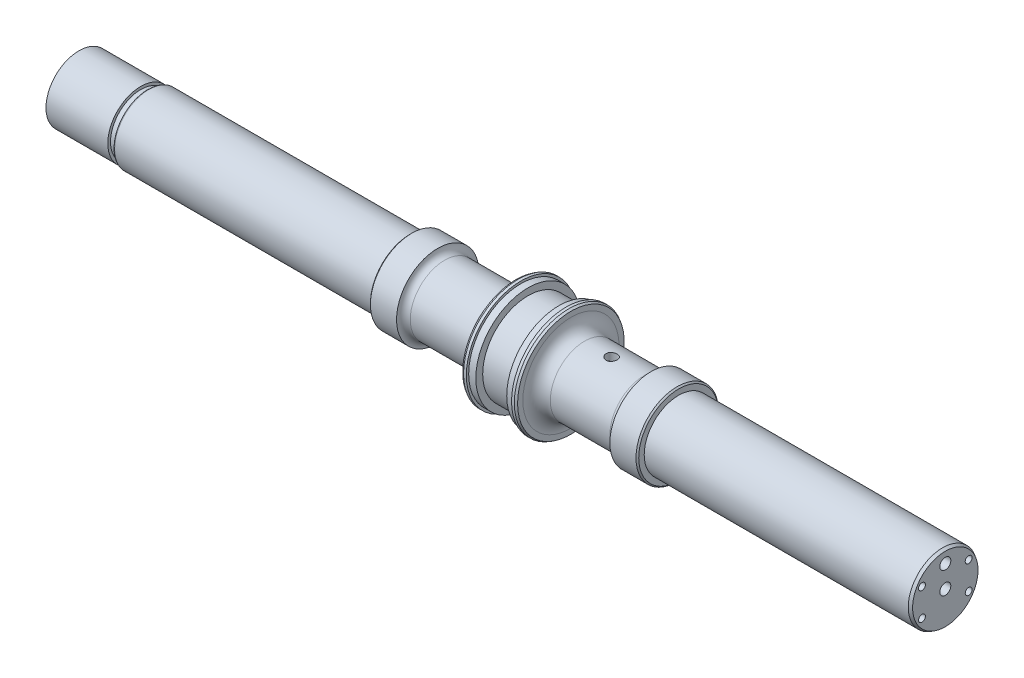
ISO-10303-21;
HEADER;
FILE_DESCRIPTION(('STEP AP214'),'2;1');
FILE_NAME('part.step','',(''),(''),'','','');
FILE_SCHEMA(('AUTOMOTIVE_DESIGN { 1 0 10303 214 1 1 1 1 }'));
ENDSEC;
DATA;
#1=APPLICATION_CONTEXT('core data for automotive mechanical design processes');
#2=APPLICATION_PROTOCOL_DEFINITION('international standard','automotive_design',2000,#1);
#3=PRODUCT_CONTEXT('',#1,'mechanical');
#4=PRODUCT('Part','Part','',(#3));
#5=PRODUCT_RELATED_PRODUCT_CATEGORY('part','',(#4));
#6=PRODUCT_DEFINITION_FORMATION('','',#4);
#7=PRODUCT_DEFINITION_CONTEXT('part definition',#1,'design');
#8=PRODUCT_DEFINITION('design','',#6,#7);
#9=PRODUCT_DEFINITION_SHAPE('','',#8);
#10=(LENGTH_UNIT() NAMED_UNIT(*) SI_UNIT(.MILLI.,.METRE.));
#11=(NAMED_UNIT(*) PLANE_ANGLE_UNIT() SI_UNIT($,.RADIAN.));
#12=(NAMED_UNIT(*) SI_UNIT($,.STERADIAN.) SOLID_ANGLE_UNIT());
#13=UNCERTAINTY_MEASURE_WITH_UNIT(LENGTH_MEASURE(1.E-05),#10,'distance_accuracy_value','');
#14=(GEOMETRIC_REPRESENTATION_CONTEXT(3) GLOBAL_UNCERTAINTY_ASSIGNED_CONTEXT((#13)) GLOBAL_UNIT_ASSIGNED_CONTEXT((#10,
#11,#12)) REPRESENTATION_CONTEXT('',''));
#15=CARTESIAN_POINT('',(0.,0.,0.));
#16=DIRECTION('',(0.,0.,1.));
#17=DIRECTION('',(1.,0.,0.));
#18=AXIS2_PLACEMENT_3D('',#15,#16,#17);
#19=CARTESIAN_POINT('',(0.,0.,0.));
#20=DIRECTION('',(1.,0.,0.));
#21=DIRECTION('',(0.,0.,-1.));
#22=AXIS2_PLACEMENT_3D('',#19,#20,#21);
#23=PLANE('',#22);
#24=CARTESIAN_POINT('',(0.,0.,0.));
#25=DIRECTION('',(-1.,0.,0.));
#26=DIRECTION('',(0.,0.,1.));
#27=AXIS2_PLACEMENT_3D('',#24,#25,#26);
#28=CIRCLE('',#27,24.);
#29=CARTESIAN_POINT('',(0.,0.,24.));
#30=VERTEX_POINT('',#29);
#31=EDGE_CURVE('E144',#30,#30,#28,.T.);
#32=ORIENTED_EDGE('',*,*,#31,.T.);
#33=EDGE_LOOP('',(#32));
#34=FACE_BOUND('',#33,.T.);
#35=ADVANCED_FACE('F32',(#34),#23,.F.);
#36=CARTESIAN_POINT('',(0.,0.,0.));
#37=DIRECTION('',(-1.,0.,0.));
#38=DIRECTION('',(0.,0.,1.));
#39=AXIS2_PLACEMENT_3D('',#36,#37,#38);
#40=CYLINDRICAL_SURFACE('',#39,24.);
#41=ORIENTED_EDGE('',*,*,#31,.F.);
#42=EDGE_LOOP('',(#41));
#43=FACE_BOUND('',#42,.T.);
#44=CARTESIAN_POINT('',(45.,0.,0.));
#45=DIRECTION('',(-1.,0.,0.));
#46=DIRECTION('',(0.,0.,1.));
#47=AXIS2_PLACEMENT_3D('',#44,#45,#46);
#48=CIRCLE('',#47,24.);
#49=CARTESIAN_POINT('',(45.,0.,24.));
#50=VERTEX_POINT('',#49);
#51=EDGE_CURVE('E141',#50,#50,#48,.T.);
#52=ORIENTED_EDGE('',*,*,#51,.T.);
#53=EDGE_LOOP('',(#52));
#54=FACE_BOUND('',#53,.T.);
#55=ADVANCED_FACE('F297',(#43,#54),#40,.T.);
#56=CARTESIAN_POINT('',(45.,24.,0.));
#57=DIRECTION('',(-1.,0.,0.));
#58=DIRECTION('',(0.,0.,1.));
#59=AXIS2_PLACEMENT_3D('',#56,#57,#58);
#60=PLANE('',#59);
#61=ORIENTED_EDGE('',*,*,#51,.F.);
#62=EDGE_LOOP('',(#61));
#63=FACE_BOUND('',#62,.T.);
#64=CARTESIAN_POINT('',(45.,0.,0.));
#65=DIRECTION('',(-1.,0.,0.));
#66=DIRECTION('',(0.,0.,1.));
#67=AXIS2_PLACEMENT_3D('',#64,#65,#66);
#68=CIRCLE('',#67,22.);
#69=CARTESIAN_POINT('',(45.,0.,22.));
#70=VERTEX_POINT('',#69);
#71=EDGE_CURVE('E138',#70,#70,#68,.T.);
#72=ORIENTED_EDGE('',*,*,#71,.T.);
#73=EDGE_LOOP('',(#72));
#74=FACE_BOUND('',#73,.T.);
#75=ADVANCED_FACE('F303',(#63,#74),#60,.F.);
#76=CARTESIAN_POINT('',(0.,0.,0.));
#77=DIRECTION('',(-1.,0.,0.));
#78=DIRECTION('',(0.,0.,1.));
#79=AXIS2_PLACEMENT_3D('',#76,#77,#78);
#80=CYLINDRICAL_SURFACE('',#79,22.);
#81=ORIENTED_EDGE('',*,*,#71,.F.);
#82=EDGE_LOOP('',(#81));
#83=FACE_BOUND('',#82,.T.);
#84=CARTESIAN_POINT('',(50.,0.,0.));
#85=DIRECTION('',(-1.,0.,0.));
#86=DIRECTION('',(0.,0.,1.));
#87=AXIS2_PLACEMENT_3D('',#84,#85,#86);
#88=CIRCLE('',#87,22.);
#89=CARTESIAN_POINT('',(50.,0.,22.));
#90=VERTEX_POINT('',#89);
#91=EDGE_CURVE('E135',#90,#90,#88,.T.);
#92=ORIENTED_EDGE('',*,*,#91,.T.);
#93=EDGE_LOOP('',(#92));
#94=FACE_BOUND('',#93,.T.);
#95=ADVANCED_FACE('F414',(#83,#94),#80,.T.);
#96=CARTESIAN_POINT('',(50.,22.,0.));
#97=DIRECTION('',(1.,0.,0.));
#98=DIRECTION('',(0.,0.,-1.));
#99=AXIS2_PLACEMENT_3D('',#96,#97,#98);
#100=PLANE('',#99);
#101=CARTESIAN_POINT('',(50.,0.,0.));
#102=DIRECTION('',(1.,0.,0.));
#103=DIRECTION('',(0.,0.,-1.));
#104=AXIS2_PLACEMENT_3D('',#101,#102,#103);
#105=CIRCLE('',#104,24.);
#106=CARTESIAN_POINT('',(50.,0.,-24.));
#107=VERTEX_POINT('',#106);
#108=EDGE_CURVE('E177',#107,#107,#105,.F.);
#109=ORIENTED_EDGE('',*,*,#108,.T.);
#110=EDGE_LOOP('',(#109));
#111=FACE_BOUND('',#110,.T.);
#112=ORIENTED_EDGE('',*,*,#91,.F.);
#113=EDGE_LOOP('',(#112));
#114=FACE_BOUND('',#113,.T.);
#115=ADVANCED_FACE('F410',(#111,#114),#100,.F.);
#116=CARTESIAN_POINT('',(0.,0.,0.));
#117=DIRECTION('',(-1.,0.,0.));
#118=DIRECTION('',(0.,0.,1.));
#119=AXIS2_PLACEMENT_3D('',#116,#117,#118);
#120=CYLINDRICAL_SURFACE('',#119,25.);
#121=CARTESIAN_POINT('',(51.,0.,0.));
#122=DIRECTION('',(1.,0.,0.));
#123=DIRECTION('',(0.,0.,-1.));
#124=AXIS2_PLACEMENT_3D('',#121,#122,#123);
#125=CIRCLE('',#124,25.);
#126=CARTESIAN_POINT('',(51.,0.,-25.));
#127=VERTEX_POINT('',#126);
#128=EDGE_CURVE('E180',#127,#127,#125,.T.);
#129=ORIENTED_EDGE('',*,*,#128,.T.);
#130=EDGE_LOOP('',(#129));
#131=FACE_BOUND('',#130,.T.);
#132=CARTESIAN_POINT('',(241.3,0.,0.));
#133=DIRECTION('',(-1.,0.,0.));
#134=DIRECTION('',(0.,0.,1.));
#135=AXIS2_PLACEMENT_3D('',#132,#133,#134);
#136=CIRCLE('',#135,25.);
#137=CARTESIAN_POINT('',(241.3,0.,25.));
#138=VERTEX_POINT('',#137);
#139=EDGE_CURVE('E132',#138,#138,#136,.T.);
#140=ORIENTED_EDGE('',*,*,#139,.T.);
#141=EDGE_LOOP('',(#140));
#142=FACE_BOUND('',#141,.T.);
#143=ADVANCED_FACE('F406',(#131,#142),#120,.T.);
#144=CARTESIAN_POINT('',(241.3,25.,0.));
#145=DIRECTION('',(1.,0.,0.));
#146=DIRECTION('',(0.,0.,-1.));
#147=AXIS2_PLACEMENT_3D('',#144,#145,#146);
#148=PLANE('',#147);
#149=CARTESIAN_POINT('',(241.3,0.,0.));
#150=DIRECTION('',(1.,0.,0.));
#151=DIRECTION('',(0.,0.,-1.));
#152=AXIS2_PLACEMENT_3D('',#149,#150,#151);
#153=CIRCLE('',#152,29.);
#154=CARTESIAN_POINT('',(241.3,0.,-29.));
#155=VERTEX_POINT('',#154);
#156=EDGE_CURVE('E171',#155,#155,#153,.F.);
#157=ORIENTED_EDGE('',*,*,#156,.T.);
#158=EDGE_LOOP('',(#157));
#159=FACE_BOUND('',#158,.T.);
#160=ORIENTED_EDGE('',*,*,#139,.F.);
#161=EDGE_LOOP('',(#160));
#162=FACE_BOUND('',#161,.T.);
#163=ADVANCED_FACE('F402',(#159,#162),#148,.F.);
#164=CARTESIAN_POINT('',(0.,0.,0.));
#165=DIRECTION('',(-1.,0.,0.));
#166=DIRECTION('',(0.,0.,1.));
#167=AXIS2_PLACEMENT_3D('',#164,#165,#166);
#168=CYLINDRICAL_SURFACE('',#167,30.);
#169=CARTESIAN_POINT('',(242.3,0.,0.));
#170=DIRECTION('',(1.,0.,0.));
#171=DIRECTION('',(0.,0.,-1.));
#172=AXIS2_PLACEMENT_3D('',#169,#170,#171);
#173=CIRCLE('',#172,30.);
#174=CARTESIAN_POINT('',(242.3,0.,-30.));
#175=VERTEX_POINT('',#174);
#176=EDGE_CURVE('E174',#175,#175,#173,.T.);
#177=ORIENTED_EDGE('',*,*,#176,.T.);
#178=EDGE_LOOP('',(#177));
#179=FACE_BOUND('',#178,.T.);
#180=CARTESIAN_POINT('',(261.3,0.,0.));
#181=DIRECTION('',(-1.,0.,0.));
#182=DIRECTION('',(0.,0.,1.));
#183=AXIS2_PLACEMENT_3D('',#180,#181,#182);
#184=CIRCLE('',#183,30.);
#185=CARTESIAN_POINT('',(261.3,0.,30.));
#186=VERTEX_POINT('',#185);
#187=EDGE_CURVE('E129',#186,#186,#184,.T.);
#188=ORIENTED_EDGE('',*,*,#187,.T.);
#189=EDGE_LOOP('',(#188));
#190=FACE_BOUND('',#189,.T.);
#191=ADVANCED_FACE('F398',(#179,#190),#168,.T.);
#192=CARTESIAN_POINT('',(0.,0.,0.));
#193=DIRECTION('',(-1.,0.,0.));
#194=DIRECTION('',(0.,0.,1.));
#195=AXIS2_PLACEMENT_3D('',#192,#193,#194);
#196=CYLINDRICAL_SURFACE('',#195,25.);
#197=CARTESIAN_POINT('',(304.,-24.6779253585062,-3.99999999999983));
#198=CARTESIAN_POINT('',(303.776866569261,-24.6779292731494,-3.99999092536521));
#199=CARTESIAN_POINT('',(303.553608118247,-24.6809844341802,-3.98126611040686));
#200=CARTESIAN_POINT('',(303.113346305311,-24.6928650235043,-3.90688891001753));
#201=CARTESIAN_POINT('',(302.896349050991,-24.7016958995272,-3.85120166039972));
#202=CARTESIAN_POINT('',(302.475045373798,-24.7241027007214,-3.70461945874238));
#203=CARTESIAN_POINT('',(302.27072885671,-24.7376747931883,-3.61375293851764));
#204=CARTESIAN_POINT('',(301.880267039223,-24.7680302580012,-3.39946083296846));
#205=CARTESIAN_POINT('',(301.694119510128,-24.7848132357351,-3.2760392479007));
#206=CARTESIAN_POINT('',(301.343562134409,-24.8198700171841,-2.99894280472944));
#207=CARTESIAN_POINT('',(301.17934146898,-24.8381548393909,-2.84502997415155));
#208=CARTESIAN_POINT('',(300.87894108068,-24.8740570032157,-2.5118341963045));
#209=CARTESIAN_POINT('',(300.742762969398,-24.8916743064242,-2.33254979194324));
#210=CARTESIAN_POINT('',(300.501608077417,-24.9243725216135,-1.9524798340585));
#211=CARTESIAN_POINT('',(300.396806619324,-24.9394389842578,-1.75158168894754));
#212=CARTESIAN_POINT('',(300.22250612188,-24.9652155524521,-1.33475199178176));
#213=CARTESIAN_POINT('',(300.153004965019,-24.9759259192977,-1.11882134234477));
#214=CARTESIAN_POINT('',(300.051854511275,-24.9917057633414,-0.680008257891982));
#215=CARTESIAN_POINT('',(300.01988776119,-24.9968225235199,-0.457200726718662));
#216=CARTESIAN_POINT('',(299.993726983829,-25.001000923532,-0.00932961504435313));
#217=CARTESIAN_POINT('',(299.99953058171,-25.0000629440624,0.21573382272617));
#218=CARTESIAN_POINT('',(300.04849697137,-24.9922751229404,0.659559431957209));
#219=CARTESIAN_POINT('',(300.091318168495,-24.9854793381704,0.878360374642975));
#220=CARTESIAN_POINT('',(300.212567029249,-24.9667997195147,1.30563068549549));
#221=CARTESIAN_POINT('',(300.290995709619,-24.9549157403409,1.51409975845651));
#222=CARTESIAN_POINT('',(300.4815769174,-24.9273026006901,1.91581197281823));
#223=CARTESIAN_POINT('',(300.593871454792,-24.9115573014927,2.10898658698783));
#224=CARTESIAN_POINT('',(300.848892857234,-24.8779731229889,2.47387934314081));
#225=CARTESIAN_POINT('',(300.991621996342,-24.8601340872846,2.64559588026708));
#226=CARTESIAN_POINT('',(301.30535912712,-24.8241131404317,2.96471443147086));
#227=CARTESIAN_POINT('',(301.476665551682,-24.8059296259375,3.11182301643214));
#228=CARTESIAN_POINT('',(301.841685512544,-24.7714627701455,3.37525361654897));
#229=CARTESIAN_POINT('',(302.035399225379,-24.7551794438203,3.49157538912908));
#230=CARTESIAN_POINT('',(302.440061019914,-24.7263563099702,3.69018063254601));
#231=CARTESIAN_POINT('',(302.651025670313,-24.7138201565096,3.77243090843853));
#232=CARTESIAN_POINT('',(303.084021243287,-24.6939728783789,3.90024708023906));
#233=CARTESIAN_POINT('',(303.306051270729,-24.6866613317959,3.94581593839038));
#234=CARTESIAN_POINT('',(303.752255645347,-24.6781720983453,3.99856699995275));
#235=CARTESIAN_POINT('',(303.976379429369,-24.676927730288,4.00616652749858));
#236=CARTESIAN_POINT('',(304.422697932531,-24.6805363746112,3.98387335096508));
#237=CARTESIAN_POINT('',(304.644892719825,-24.6853891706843,3.9539819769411));
#238=CARTESIAN_POINT('',(305.079733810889,-24.7005838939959,3.8579105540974));
#239=CARTESIAN_POINT('',(305.292427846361,-24.7108939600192,3.79194106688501));
#240=CARTESIAN_POINT('',(305.703740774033,-24.7358149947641,3.62580613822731));
#241=CARTESIAN_POINT('',(305.902358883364,-24.7504262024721,3.52563879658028));
#242=CARTESIAN_POINT('',(306.281744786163,-24.7824590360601,3.29295930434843));
#243=CARTESIAN_POINT('',(306.46234590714,-24.7999035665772,3.16017860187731));
#244=CARTESIAN_POINT('',(306.798852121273,-24.8355696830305,2.86641208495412));
#245=CARTESIAN_POINT('',(306.95475561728,-24.853791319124,2.70542444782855));
#246=CARTESIAN_POINT('',(307.238954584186,-24.8891684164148,2.35796950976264));
#247=CARTESIAN_POINT('',(307.366972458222,-24.9063120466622,2.17127376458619));
#248=CARTESIAN_POINT('',(307.589826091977,-24.9374141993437,1.77878369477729));
#249=CARTESIAN_POINT('',(307.684662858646,-24.951372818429,1.57298994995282));
#250=CARTESIAN_POINT('',(307.838025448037,-24.9744805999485,1.14898755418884));
#251=CARTESIAN_POINT('',(307.896699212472,-24.9836493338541,0.930833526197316));
#252=CARTESIAN_POINT('',(307.976547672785,-24.9962267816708,0.48761051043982));
#253=CARTESIAN_POINT('',(307.997725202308,-24.9996359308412,0.262542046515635));
#254=CARTESIAN_POINT('',(308.001903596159,-25.0003046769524,-0.185436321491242));
#255=CARTESIAN_POINT('',(307.985327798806,-24.9976324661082,-0.408342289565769));
#256=CARTESIAN_POINT('',(307.915382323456,-24.9865772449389,-0.84815266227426));
#257=CARTESIAN_POINT('',(307.862012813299,-24.9781942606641,-1.06505709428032));
#258=CARTESIAN_POINT('',(307.720152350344,-24.9566555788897,-1.48656424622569));
#259=CARTESIAN_POINT('',(307.631694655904,-24.943504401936,-1.69117840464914));
#260=CARTESIAN_POINT('',(307.422215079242,-24.9138685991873,-2.08272639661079));
#261=CARTESIAN_POINT('',(307.301191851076,-24.8973838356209,-2.2696594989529));
#262=CARTESIAN_POINT('',(307.028503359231,-24.8626909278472,-2.62267778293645));
#263=CARTESIAN_POINT('',(306.876526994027,-24.8444663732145,-2.78852106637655));
#264=CARTESIAN_POINT('',(306.546900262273,-24.8084646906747,-3.09250238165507));
#265=CARTESIAN_POINT('',(306.369243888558,-24.7906876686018,-3.23063391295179));
#266=CARTESIAN_POINT('',(305.991941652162,-24.7574701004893,-3.47608383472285));
#267=CARTESIAN_POINT('',(305.792161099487,-24.7420453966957,-3.58319732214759));
#268=CARTESIAN_POINT('',(305.377283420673,-24.7154654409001,-3.76218364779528));
#269=CARTESIAN_POINT('',(305.162202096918,-24.7043058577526,-3.83409225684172));
#270=CARTESIAN_POINT('',(304.788524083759,-24.6900374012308,-3.9247197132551));
#271=CARTESIAN_POINT('',(304.632209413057,-24.6855201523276,-3.95290540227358));
#272=CARTESIAN_POINT('',(304.317284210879,-24.679462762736,-3.99054862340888));
#273=CARTESIAN_POINT('',(304.158673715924,-24.6779225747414,-4.00000645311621));
#274=CARTESIAN_POINT('',(304.,-24.6779253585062,-3.99999999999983));
#275=B_SPLINE_CURVE_WITH_KNOTS('',3,(#197,#198,#199,#200,#201,#202,#203,#204,#205,#206,#207,
#208,#209,#210,#211,#212,#213,#214,#215,#216,#217,#218,#219,#220,#221,#222,#223,#224,#225,#226,
#227,#228,#229,#230,#231,#232,#233,#234,#235,#236,#237,#238,#239,#240,#241,#242,#243,#244,#245,
#246,#247,#248,#249,#250,#251,#252,#253,#254,#255,#256,#257,#258,#259,#260,#261,#262,#263,#264,
#265,#266,#267,#268,#269,#270,#271,#272,#273,#274),.UNSPECIFIED.,.T.,.F.,(4,2,2,2,2,2,2,2,2,2,2,
2,2,2,2,2,2,2,2,2,2,2,2,2,2,2,2,2,2,2,2,2,2,2,2,2,2,2,4),(0.,0.668820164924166,1.33827208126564,
2.00718407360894,2.67601391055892,3.35028538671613,4.02459560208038,4.70260619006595,
5.38057610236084,6.05276970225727,6.72492103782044,7.39093524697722,8.05696847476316,
8.72583436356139,9.39475024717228,10.0711476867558,10.747550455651,11.4246106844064,
12.1016162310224,12.7711641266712,13.4406882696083,14.1063459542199,14.7720406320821,
15.4434123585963,16.1148274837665,16.7926485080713,17.4704489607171,18.1454578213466,
18.8204156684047,19.4878423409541,20.1552659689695,20.8220584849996,21.4888785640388,
22.1627644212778,22.8368081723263,23.5152080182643,24.1929171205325,24.6685332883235,
25.1441418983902),.UNSPECIFIED.);
#276=CARTESIAN_POINT('',(304.,-24.6779253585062,-3.99999999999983));
#277=VERTEX_POINT('',#276);
#278=EDGE_CURVE('E216',#277,#277,#275,.T.);
#279=ORIENTED_EDGE('',*,*,#278,.T.);
#280=EDGE_LOOP('',(#279));
#281=FACE_BOUND('',#280,.T.);
#282=CARTESIAN_POINT('',(266.3,0.,0.));
#283=DIRECTION('',(-1.,0.,0.));
#284=DIRECTION('',(0.,0.,1.));
#285=AXIS2_PLACEMENT_3D('',#282,#283,#284);
#286=CIRCLE('',#285,25.);
#287=CARTESIAN_POINT('',(266.3,0.,25.));
#288=VERTEX_POINT('',#287);
#289=EDGE_CURVE('E162',#288,#288,#286,.F.);
#290=ORIENTED_EDGE('',*,*,#289,.T.);
#291=EDGE_LOOP('',(#290));
#292=FACE_BOUND('',#291,.T.);
#293=CARTESIAN_POINT('',(308.3,0.,0.));
#294=DIRECTION('',(1.,0.,0.));
#295=DIRECTION('',(0.,0.,-1.));
#296=AXIS2_PLACEMENT_3D('',#293,#294,#295);
#297=CIRCLE('',#296,25.);
#298=CARTESIAN_POINT('',(308.3,0.,-25.));
#299=VERTEX_POINT('',#298);
#300=EDGE_CURVE('E147',#299,#299,#297,.F.);
#301=ORIENTED_EDGE('',*,*,#300,.T.);
#302=EDGE_LOOP('',(#301));
#303=FACE_BOUND('',#302,.T.);
#304=ADVANCED_FACE('F393',(#281,#292,#303),#196,.T.);
#305=CARTESIAN_POINT('',(318.3,25.,0.));
#306=DIRECTION('',(1.,0.,0.));
#307=DIRECTION('',(0.,0.,-1.));
#308=AXIS2_PLACEMENT_3D('',#305,#306,#307);
#309=PLANE('',#308);
#310=CARTESIAN_POINT('',(318.3,0.,0.));
#311=DIRECTION('',(1.,0.,0.));
#312=DIRECTION('',(0.,0.,-1.));
#313=AXIS2_PLACEMENT_3D('',#310,#311,#312);
#314=CIRCLE('',#313,38.8339745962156);
#315=CARTESIAN_POINT('',(318.3,0.,-38.8339745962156));
#316=VERTEX_POINT('',#315);
#317=EDGE_CURVE('E195',#316,#316,#314,.F.);
#318=ORIENTED_EDGE('',*,*,#317,.T.);
#319=EDGE_LOOP('',(#318));
#320=FACE_BOUND('',#319,.T.);
#321=CARTESIAN_POINT('',(318.3,0.,0.));
#322=DIRECTION('',(1.,0.,0.));
#323=DIRECTION('',(0.,0.,-1.));
#324=AXIS2_PLACEMENT_3D('',#321,#322,#323);
#325=CIRCLE('',#324,35.);
#326=CARTESIAN_POINT('',(318.3,0.,-35.));
#327=VERTEX_POINT('',#326);
#328=EDGE_CURVE('E150',#327,#327,#325,.T.);
#329=ORIENTED_EDGE('',*,*,#328,.T.);
#330=EDGE_LOOP('',(#329));
#331=FACE_BOUND('',#330,.T.);
#332=ADVANCED_FACE('F390',(#320,#331),#309,.F.);
#333=CARTESIAN_POINT('',(0.,0.,0.));
#334=DIRECTION('',(-1.,0.,0.));
#335=DIRECTION('',(0.,0.,1.));
#336=AXIS2_PLACEMENT_3D('',#333,#334,#335);
#337=CYLINDRICAL_SURFACE('',#336,39.7);
#338=CARTESIAN_POINT('',(319.8,0.,0.));
#339=DIRECTION('',(1.,0.,0.));
#340=DIRECTION('',(0.,0.,-1.));
#341=AXIS2_PLACEMENT_3D('',#338,#339,#340);
#342=CIRCLE('',#341,39.7);
#343=CARTESIAN_POINT('',(319.8,0.,-39.7));
#344=VERTEX_POINT('',#343);
#345=EDGE_CURVE('E198',#344,#344,#342,.T.);
#346=ORIENTED_EDGE('',*,*,#345,.T.);
#347=EDGE_LOOP('',(#346));
#348=FACE_BOUND('',#347,.T.);
#349=CARTESIAN_POINT('',(321.85,0.,0.));
#350=DIRECTION('',(-1.,0.,0.));
#351=DIRECTION('',(0.,0.,1.));
#352=AXIS2_PLACEMENT_3D('',#349,#350,#351);
#353=CIRCLE('',#352,39.7);
#354=CARTESIAN_POINT('',(321.85,0.,39.7));
#355=VERTEX_POINT('',#354);
#356=EDGE_CURVE('E126',#355,#355,#353,.T.);
#357=ORIENTED_EDGE('',*,*,#356,.T.);
#358=EDGE_LOOP('',(#357));
#359=FACE_BOUND('',#358,.T.);
#360=ADVANCED_FACE('F386',(#348,#359),#337,.T.);
#361=CARTESIAN_POINT('',(321.85,39.7,0.));
#362=DIRECTION('',(-1.,0.,0.));
#363=DIRECTION('',(0.,0.,1.));
#364=AXIS2_PLACEMENT_3D('',#361,#362,#363);
#365=PLANE('',#364);
#366=ORIENTED_EDGE('',*,*,#356,.F.);
#367=EDGE_LOOP('',(#366));
#368=FACE_BOUND('',#367,.T.);
#369=CARTESIAN_POINT('',(321.85,0.,0.));
#370=DIRECTION('',(-1.,0.,0.));
#371=DIRECTION('',(0.,0.,1.));
#372=AXIS2_PLACEMENT_3D('',#369,#370,#371);
#373=CIRCLE('',#372,38.);
#374=CARTESIAN_POINT('',(321.85,0.,38.));
#375=VERTEX_POINT('',#374);
#376=EDGE_CURVE('E123',#375,#375,#373,.T.);
#377=ORIENTED_EDGE('',*,*,#376,.T.);
#378=EDGE_LOOP('',(#377));
#379=FACE_BOUND('',#378,.T.);
#380=ADVANCED_FACE('F382',(#368,#379),#365,.F.);
#381=CARTESIAN_POINT('',(0.,0.,0.));
#382=DIRECTION('',(-1.,0.,0.));
#383=DIRECTION('',(0.,0.,1.));
#384=AXIS2_PLACEMENT_3D('',#381,#382,#383);
#385=CYLINDRICAL_SURFACE('',#384,38.);
#386=ORIENTED_EDGE('',*,*,#376,.F.);
#387=EDGE_LOOP('',(#386));
#388=FACE_BOUND('',#387,.T.);
#389=CARTESIAN_POINT('',(327.05,0.,0.));
#390=DIRECTION('',(-1.,0.,0.));
#391=DIRECTION('',(0.,0.,1.));
#392=AXIS2_PLACEMENT_3D('',#389,#390,#391);
#393=CIRCLE('',#392,38.);
#394=CARTESIAN_POINT('',(327.05,0.,38.));
#395=VERTEX_POINT('',#394);
#396=EDGE_CURVE('E120',#395,#395,#393,.T.);
#397=ORIENTED_EDGE('',*,*,#396,.T.);
#398=EDGE_LOOP('',(#397));
#399=FACE_BOUND('',#398,.T.);
#400=ADVANCED_FACE('F378',(#388,#399),#385,.T.);
#401=CARTESIAN_POINT('',(327.05,38.,0.));
#402=DIRECTION('',(-1.,0.,0.));
#403=DIRECTION('',(0.,0.,1.));
#404=AXIS2_PLACEMENT_3D('',#401,#402,#403);
#405=PLANE('',#404);
#406=ORIENTED_EDGE('',*,*,#396,.F.);
#407=EDGE_LOOP('',(#406));
#408=FACE_BOUND('',#407,.T.);
#409=CARTESIAN_POINT('',(327.05,0.,0.));
#410=DIRECTION('',(-1.,0.,0.));
#411=DIRECTION('',(0.,0.,1.));
#412=AXIS2_PLACEMENT_3D('',#409,#410,#411);
#413=CIRCLE('',#412,33.);
#414=CARTESIAN_POINT('',(327.05,0.,33.));
#415=VERTEX_POINT('',#414);
#416=EDGE_CURVE('E117',#415,#415,#413,.T.);
#417=ORIENTED_EDGE('',*,*,#416,.T.);
#418=EDGE_LOOP('',(#417));
#419=FACE_BOUND('',#418,.T.);
#420=ADVANCED_FACE('F374',(#408,#419),#405,.F.);
#421=CARTESIAN_POINT('',(0.,0.,0.));
#422=DIRECTION('',(-1.,0.,0.));
#423=DIRECTION('',(0.,0.,1.));
#424=AXIS2_PLACEMENT_3D('',#421,#422,#423);
#425=CYLINDRICAL_SURFACE('',#424,33.);
#426=ORIENTED_EDGE('',*,*,#416,.F.);
#427=EDGE_LOOP('',(#426));
#428=FACE_BOUND('',#427,.T.);
#429=CARTESIAN_POINT('',(349.55,0.,0.));
#430=DIRECTION('',(-1.,0.,0.));
#431=DIRECTION('',(0.,0.,1.));
#432=AXIS2_PLACEMENT_3D('',#429,#430,#431);
#433=CIRCLE('',#432,33.);
#434=CARTESIAN_POINT('',(349.55,0.,33.));
#435=VERTEX_POINT('',#434);
#436=EDGE_CURVE('E114',#435,#435,#433,.T.);
#437=ORIENTED_EDGE('',*,*,#436,.T.);
#438=EDGE_LOOP('',(#437));
#439=FACE_BOUND('',#438,.T.);
#440=ADVANCED_FACE('F370',(#428,#439),#425,.T.);
#441=CARTESIAN_POINT('',(349.55,33.,0.));
#442=DIRECTION('',(1.,0.,0.));
#443=DIRECTION('',(0.,0.,-1.));
#444=AXIS2_PLACEMENT_3D('',#441,#442,#443);
#445=PLANE('',#444);
#446=ORIENTED_EDGE('',*,*,#436,.F.);
#447=EDGE_LOOP('',(#446));
#448=FACE_BOUND('',#447,.T.);
#449=CARTESIAN_POINT('',(349.55,0.,0.));
#450=DIRECTION('',(-1.,0.,0.));
#451=DIRECTION('',(0.,0.,1.));
#452=AXIS2_PLACEMENT_3D('',#449,#450,#451);
#453=CIRCLE('',#452,38.);
#454=CARTESIAN_POINT('',(349.55,0.,38.));
#455=VERTEX_POINT('',#454);
#456=EDGE_CURVE('E111',#455,#455,#453,.T.);
#457=ORIENTED_EDGE('',*,*,#456,.T.);
#458=EDGE_LOOP('',(#457));
#459=FACE_BOUND('',#458,.T.);
#460=ADVANCED_FACE('F363',(#448,#459),#445,.F.);
#461=CARTESIAN_POINT('',(0.,0.,0.));
#462=DIRECTION('',(-1.,0.,0.));
#463=DIRECTION('',(0.,0.,1.));
#464=AXIS2_PLACEMENT_3D('',#461,#462,#463);
#465=CYLINDRICAL_SURFACE('',#464,38.);
#466=ORIENTED_EDGE('',*,*,#456,.F.);
#467=EDGE_LOOP('',(#466));
#468=FACE_BOUND('',#467,.T.);
#469=CARTESIAN_POINT('',(354.75,0.,0.));
#470=DIRECTION('',(-1.,0.,0.));
#471=DIRECTION('',(0.,0.,1.));
#472=AXIS2_PLACEMENT_3D('',#469,#470,#471);
#473=CIRCLE('',#472,38.);
#474=CARTESIAN_POINT('',(354.75,0.,38.));
#475=VERTEX_POINT('',#474);
#476=EDGE_CURVE('E108',#475,#475,#473,.T.);
#477=ORIENTED_EDGE('',*,*,#476,.T.);
#478=EDGE_LOOP('',(#477));
#479=FACE_BOUND('',#478,.T.);
#480=ADVANCED_FACE('F357',(#468,#479),#465,.T.);
#481=CARTESIAN_POINT('',(354.75,38.,0.));
#482=DIRECTION('',(1.,0.,0.));
#483=DIRECTION('',(0.,0.,-1.));
#484=AXIS2_PLACEMENT_3D('',#481,#482,#483);
#485=PLANE('',#484);
#486=ORIENTED_EDGE('',*,*,#476,.F.);
#487=EDGE_LOOP('',(#486));
#488=FACE_BOUND('',#487,.T.);
#489=CARTESIAN_POINT('',(354.75,0.,0.));
#490=DIRECTION('',(-1.,0.,0.));
#491=DIRECTION('',(0.,0.,1.));
#492=AXIS2_PLACEMENT_3D('',#489,#490,#491);
#493=CIRCLE('',#492,39.7);
#494=CARTESIAN_POINT('',(354.75,0.,39.7));
#495=VERTEX_POINT('',#494);
#496=EDGE_CURVE('E105',#495,#495,#493,.T.);
#497=ORIENTED_EDGE('',*,*,#496,.T.);
#498=EDGE_LOOP('',(#497));
#499=FACE_BOUND('',#498,.T.);
#500=ADVANCED_FACE('F352',(#488,#499),#485,.F.);
#501=CARTESIAN_POINT('',(0.,0.,0.));
#502=DIRECTION('',(-1.,0.,0.));
#503=DIRECTION('',(0.,0.,1.));
#504=AXIS2_PLACEMENT_3D('',#501,#502,#503);
#505=CYLINDRICAL_SURFACE('',#504,39.7);
#506=CARTESIAN_POINT('',(356.8,0.,0.));
#507=DIRECTION('',(-1.,0.,0.));
#508=DIRECTION('',(0.,0.,1.));
#509=AXIS2_PLACEMENT_3D('',#506,#507,#508);
#510=CIRCLE('',#509,39.7);
#511=CARTESIAN_POINT('',(356.8,0.,39.7));
#512=VERTEX_POINT('',#511);
#513=EDGE_CURVE('E189',#512,#512,#510,.T.);
#514=ORIENTED_EDGE('',*,*,#513,.T.);
#515=EDGE_LOOP('',(#514));
#516=FACE_BOUND('',#515,.T.);
#517=ORIENTED_EDGE('',*,*,#496,.F.);
#518=EDGE_LOOP('',(#517));
#519=FACE_BOUND('',#518,.T.);
#520=ADVANCED_FACE('F349',(#516,#519),#505,.T.);
#521=CARTESIAN_POINT('',(358.3,39.7,0.));
#522=DIRECTION('',(-1.,0.,0.));
#523=DIRECTION('',(0.,0.,1.));
#524=AXIS2_PLACEMENT_3D('',#521,#522,#523);
#525=PLANE('',#524);
#526=CARTESIAN_POINT('',(358.3,0.,0.));
#527=DIRECTION('',(-1.,0.,0.));
#528=DIRECTION('',(0.,0.,1.));
#529=AXIS2_PLACEMENT_3D('',#526,#527,#528);
#530=CIRCLE('',#529,38.8339745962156);
#531=CARTESIAN_POINT('',(358.3,0.,38.8339745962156));
#532=VERTEX_POINT('',#531);
#533=EDGE_CURVE('E192',#532,#532,#530,.F.);
#534=ORIENTED_EDGE('',*,*,#533,.T.);
#535=EDGE_LOOP('',(#534));
#536=FACE_BOUND('',#535,.T.);
#537=CARTESIAN_POINT('',(358.3,0.,0.));
#538=DIRECTION('',(-1.,0.,0.));
#539=DIRECTION('',(0.,0.,1.));
#540=AXIS2_PLACEMENT_3D('',#537,#538,#539);
#541=CIRCLE('',#540,35.);
#542=CARTESIAN_POINT('',(358.3,0.,35.));
#543=VERTEX_POINT('',#542);
#544=EDGE_CURVE('E153',#543,#543,#541,.T.);
#545=ORIENTED_EDGE('',*,*,#544,.T.);
#546=EDGE_LOOP('',(#545));
#547=FACE_BOUND('',#546,.T.);
#548=ADVANCED_FACE('F294',(#536,#547),#525,.F.);
#549=CARTESIAN_POINT('',(0.,0.,0.));
#550=DIRECTION('',(-1.,0.,0.));
#551=DIRECTION('',(0.,0.,1.));
#552=AXIS2_PLACEMENT_3D('',#549,#550,#551);
#553=CYLINDRICAL_SURFACE('',#552,25.);
#554=CARTESIAN_POINT('',(388.,24.6779253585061,4.));
#555=CARTESIAN_POINT('',(387.776866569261,24.6779292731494,3.99999092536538));
#556=CARTESIAN_POINT('',(387.553608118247,24.6809844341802,3.98126611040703));
#557=CARTESIAN_POINT('',(387.113346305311,24.6928650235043,3.90688891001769));
#558=CARTESIAN_POINT('',(386.896349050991,24.7016958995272,3.85120166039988));
#559=CARTESIAN_POINT('',(386.475045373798,24.7241027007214,3.70461945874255));
#560=CARTESIAN_POINT('',(386.27072885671,24.7376747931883,3.61375293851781));
#561=CARTESIAN_POINT('',(385.880267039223,24.7680302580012,3.39946083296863));
#562=CARTESIAN_POINT('',(385.694119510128,24.784813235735,3.27603924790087));
#563=CARTESIAN_POINT('',(385.343562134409,24.819870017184,2.99894280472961));
#564=CARTESIAN_POINT('',(385.17934146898,24.8381548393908,2.84502997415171));
#565=CARTESIAN_POINT('',(384.87894108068,24.8740570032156,2.51183419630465));
#566=CARTESIAN_POINT('',(384.742762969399,24.8916743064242,2.3325497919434));
#567=CARTESIAN_POINT('',(384.501608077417,24.9243725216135,1.95247983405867));
#568=CARTESIAN_POINT('',(384.396806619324,24.9394389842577,1.75158168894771));
#569=CARTESIAN_POINT('',(384.22250612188,24.9652155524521,1.33475199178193));
#570=CARTESIAN_POINT('',(384.153004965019,24.9759259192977,1.11882134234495));
#571=CARTESIAN_POINT('',(384.051854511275,24.9917057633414,0.680008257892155));
#572=CARTESIAN_POINT('',(384.01988776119,24.9968225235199,0.457200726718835));
#573=CARTESIAN_POINT('',(383.993726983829,25.001000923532,0.00932961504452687));
#574=CARTESIAN_POINT('',(383.99953058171,25.0000629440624,-0.215733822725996));
#575=CARTESIAN_POINT('',(384.04849697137,24.9922751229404,-0.659559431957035));
#576=CARTESIAN_POINT('',(384.091318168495,24.9854793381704,-0.878360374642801));
#577=CARTESIAN_POINT('',(384.212567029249,24.9667997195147,-1.30563068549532));
#578=CARTESIAN_POINT('',(384.290995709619,24.9549157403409,-1.51409975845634));
#579=CARTESIAN_POINT('',(384.4815769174,24.9273026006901,-1.91581197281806));
#580=CARTESIAN_POINT('',(384.593871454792,24.9115573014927,-2.10898658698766));
#581=CARTESIAN_POINT('',(384.848892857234,24.8779731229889,-2.47387934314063));
#582=CARTESIAN_POINT('',(384.991621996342,24.8601340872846,-2.6455958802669));
#583=CARTESIAN_POINT('',(385.30535912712,24.8241131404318,-2.96471443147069));
#584=CARTESIAN_POINT('',(385.476665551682,24.8059296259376,-3.11182301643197));
#585=CARTESIAN_POINT('',(385.841685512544,24.7714627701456,-3.3752536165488));
#586=CARTESIAN_POINT('',(386.035399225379,24.7551794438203,-3.49157538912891));
#587=CARTESIAN_POINT('',(386.440061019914,24.7263563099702,-3.69018063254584));
#588=CARTESIAN_POINT('',(386.651025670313,24.7138201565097,-3.77243090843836));
#589=CARTESIAN_POINT('',(387.084021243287,24.6939728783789,-3.90024708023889));
#590=CARTESIAN_POINT('',(387.306051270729,24.686661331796,-3.94581593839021));
#591=CARTESIAN_POINT('',(387.752255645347,24.6781720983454,-3.99856699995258));
#592=CARTESIAN_POINT('',(387.976379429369,24.676927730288,-4.00616652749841));
#593=CARTESIAN_POINT('',(388.422697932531,24.6805363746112,-3.98387335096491));
#594=CARTESIAN_POINT('',(388.644892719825,24.6853891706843,-3.95398197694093));
#595=CARTESIAN_POINT('',(389.079733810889,24.7005838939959,-3.85791055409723));
#596=CARTESIAN_POINT('',(389.292427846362,24.7108939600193,-3.79194106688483));
#597=CARTESIAN_POINT('',(389.703740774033,24.7358149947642,-3.62580613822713));
#598=CARTESIAN_POINT('',(389.902358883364,24.7504262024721,-3.52563879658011));
#599=CARTESIAN_POINT('',(390.281744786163,24.7824590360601,-3.29295930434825));
#600=CARTESIAN_POINT('',(390.46234590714,24.7999035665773,-3.16017860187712));
#601=CARTESIAN_POINT('',(390.798852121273,24.8355696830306,-2.86641208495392));
#602=CARTESIAN_POINT('',(390.95475561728,24.8537913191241,-2.70542444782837));
#603=CARTESIAN_POINT('',(391.238954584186,24.8891684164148,-2.35796950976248));
#604=CARTESIAN_POINT('',(391.366972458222,24.9063120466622,-2.17127376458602));
#605=CARTESIAN_POINT('',(391.589826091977,24.9374141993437,-1.77878369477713));
#606=CARTESIAN_POINT('',(391.684662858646,24.951372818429,-1.57298994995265));
#607=CARTESIAN_POINT('',(391.838025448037,24.9744805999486,-1.14898755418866));
#608=CARTESIAN_POINT('',(391.896699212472,24.9836493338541,-0.930833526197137));
#609=CARTESIAN_POINT('',(391.976547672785,24.9962267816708,-0.487610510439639));
#610=CARTESIAN_POINT('',(391.997725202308,24.9996359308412,-0.262542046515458));
#611=CARTESIAN_POINT('',(392.001903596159,25.0003046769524,0.185436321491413));
#612=CARTESIAN_POINT('',(391.985327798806,24.9976324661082,0.408342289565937));
#613=CARTESIAN_POINT('',(391.915382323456,24.9865772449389,0.848152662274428));
#614=CARTESIAN_POINT('',(391.862012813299,24.9781942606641,1.06505709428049));
#615=CARTESIAN_POINT('',(391.720152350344,24.9566555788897,1.48656424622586));
#616=CARTESIAN_POINT('',(391.631694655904,24.943504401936,1.69117840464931));
#617=CARTESIAN_POINT('',(391.422215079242,24.9138685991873,2.08272639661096));
#618=CARTESIAN_POINT('',(391.301191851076,24.8973838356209,2.26965949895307));
#619=CARTESIAN_POINT('',(391.028503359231,24.8626909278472,2.62267778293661));
#620=CARTESIAN_POINT('',(390.876526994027,24.8444663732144,2.78852106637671));
#621=CARTESIAN_POINT('',(390.546900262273,24.8084646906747,3.09250238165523));
#622=CARTESIAN_POINT('',(390.369243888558,24.7906876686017,3.23063391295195));
#623=CARTESIAN_POINT('',(389.991941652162,24.7574701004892,3.47608383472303));
#624=CARTESIAN_POINT('',(389.792161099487,24.7420453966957,3.58319732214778));
#625=CARTESIAN_POINT('',(389.377283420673,24.7154654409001,3.76218364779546));
#626=CARTESIAN_POINT('',(389.162202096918,24.7043058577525,3.83409225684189));
#627=CARTESIAN_POINT('',(388.788524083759,24.6900374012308,3.92471971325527));
#628=CARTESIAN_POINT('',(388.632209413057,24.6855201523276,3.95290540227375));
#629=CARTESIAN_POINT('',(388.317284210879,24.679462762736,3.99054862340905));
#630=CARTESIAN_POINT('',(388.158673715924,24.6779225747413,4.00000645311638));
#631=CARTESIAN_POINT('',(388.,24.6779253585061,4.));
#632=B_SPLINE_CURVE_WITH_KNOTS('',3,(#554,#555,#556,#557,#558,#559,#560,#561,#562,#563,#564,
#565,#566,#567,#568,#569,#570,#571,#572,#573,#574,#575,#576,#577,#578,#579,#580,#581,#582,#583,
#584,#585,#586,#587,#588,#589,#590,#591,#592,#593,#594,#595,#596,#597,#598,#599,#600,#601,#602,
#603,#604,#605,#606,#607,#608,#609,#610,#611,#612,#613,#614,#615,#616,#617,#618,#619,#620,#621,
#622,#623,#624,#625,#626,#627,#628,#629,#630,#631),.UNSPECIFIED.,.T.,.F.,(4,2,2,2,2,2,2,2,2,2,2,
2,2,2,2,2,2,2,2,2,2,2,2,2,2,2,2,2,2,2,2,2,2,2,2,2,2,2,4),(0.,0.668820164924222,1.33827208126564,
2.00718407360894,2.67601391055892,3.35028538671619,4.02459560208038,4.70260619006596,
5.38057610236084,6.05276970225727,6.72492103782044,7.39093524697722,8.05696847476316,
8.7258343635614,9.39475024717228,10.0711476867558,10.747550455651,11.4246106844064,
12.1016162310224,12.7711641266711,13.4406882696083,14.1063459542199,14.7720406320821,
15.4434123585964,16.1148274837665,16.7926485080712,17.4704489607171,18.1454578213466,
18.8204156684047,19.4878423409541,20.1552659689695,20.8220584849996,21.4888785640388,
22.1627644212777,22.8368081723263,23.5152080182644,24.1929171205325,24.6685332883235,
25.1441418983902),.UNSPECIFIED.);
#633=CARTESIAN_POINT('',(388.,24.6779253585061,4.));
#634=VERTEX_POINT('',#633);
#635=EDGE_CURVE('E213',#634,#634,#632,.T.);
#636=ORIENTED_EDGE('',*,*,#635,.T.);
#637=EDGE_LOOP('',(#636));
#638=FACE_BOUND('',#637,.T.);
#639=CARTESIAN_POINT('',(411.7,0.,0.));
#640=DIRECTION('',(1.,0.,0.));
#641=DIRECTION('',(0.,0.,-1.));
#642=AXIS2_PLACEMENT_3D('',#639,#640,#641);
#643=CIRCLE('',#642,25.);
#644=CARTESIAN_POINT('',(411.7,0.,-25.));
#645=VERTEX_POINT('',#644);
#646=EDGE_CURVE('E159',#645,#645,#643,.F.);
#647=ORIENTED_EDGE('',*,*,#646,.T.);
#648=EDGE_LOOP('',(#647));
#649=FACE_BOUND('',#648,.T.);
#650=CARTESIAN_POINT('',(368.3,0.,0.));
#651=DIRECTION('',(-1.,0.,0.));
#652=DIRECTION('',(0.,0.,1.));
#653=AXIS2_PLACEMENT_3D('',#650,#651,#652);
#654=CIRCLE('',#653,25.);
#655=CARTESIAN_POINT('',(368.3,0.,25.));
#656=VERTEX_POINT('',#655);
#657=EDGE_CURVE('E156',#656,#656,#654,.F.);
#658=ORIENTED_EDGE('',*,*,#657,.T.);
#659=EDGE_LOOP('',(#658));
#660=FACE_BOUND('',#659,.T.);
#661=ADVANCED_FACE('F231',(#638,#649,#660),#553,.T.);
#662=CARTESIAN_POINT('',(0.,0.,0.));
#663=DIRECTION('',(-1.,0.,0.));
#664=DIRECTION('',(0.,0.,1.));
#665=AXIS2_PLACEMENT_3D('',#662,#663,#664);
#666=CYLINDRICAL_SURFACE('',#665,30.);
#667=CARTESIAN_POINT('',(435.7,0.,0.));
#668=DIRECTION('',(-1.,0.,0.));
#669=DIRECTION('',(0.,0.,1.));
#670=AXIS2_PLACEMENT_3D('',#667,#668,#669);
#671=CIRCLE('',#670,30.);
#672=CARTESIAN_POINT('',(435.7,0.,30.));
#673=VERTEX_POINT('',#672);
#674=EDGE_CURVE('E165',#673,#673,#671,.T.);
#675=ORIENTED_EDGE('',*,*,#674,.T.);
#676=EDGE_LOOP('',(#675));
#677=FACE_BOUND('',#676,.T.);
#678=CARTESIAN_POINT('',(416.7,0.,0.));
#679=DIRECTION('',(-1.,0.,0.));
#680=DIRECTION('',(0.,0.,1.));
#681=AXIS2_PLACEMENT_3D('',#678,#679,#680);
#682=CIRCLE('',#681,30.);
#683=CARTESIAN_POINT('',(416.7,0.,30.));
#684=VERTEX_POINT('',#683);
#685=EDGE_CURVE('E102',#684,#684,#682,.T.);
#686=ORIENTED_EDGE('',*,*,#685,.F.);
#687=EDGE_LOOP('',(#686));
#688=FACE_BOUND('',#687,.T.);
#689=ADVANCED_FACE('F287',(#677,#688),#666,.T.);
#690=CARTESIAN_POINT('',(436.7,30.,0.));
#691=DIRECTION('',(-1.,0.,0.));
#692=DIRECTION('',(0.,0.,1.));
#693=AXIS2_PLACEMENT_3D('',#690,#691,#692);
#694=PLANE('',#693);
#695=CARTESIAN_POINT('',(436.7,0.,0.));
#696=DIRECTION('',(-1.,0.,0.));
#697=DIRECTION('',(0.,0.,1.));
#698=AXIS2_PLACEMENT_3D('',#695,#696,#697);
#699=CIRCLE('',#698,29.);
#700=CARTESIAN_POINT('',(436.7,0.,29.));
#701=VERTEX_POINT('',#700);
#702=EDGE_CURVE('E168',#701,#701,#699,.F.);
#703=ORIENTED_EDGE('',*,*,#702,.T.);
#704=EDGE_LOOP('',(#703));
#705=FACE_BOUND('',#704,.T.);
#706=CARTESIAN_POINT('',(436.7,0.,0.));
#707=DIRECTION('',(-1.,0.,0.));
#708=DIRECTION('',(0.,0.,1.));
#709=AXIS2_PLACEMENT_3D('',#706,#707,#708);
#710=CIRCLE('',#709,25.);
#711=CARTESIAN_POINT('',(436.7,0.,25.));
#712=VERTEX_POINT('',#711);
#713=EDGE_CURVE('E93',#712,#712,#710,.T.);
#714=ORIENTED_EDGE('',*,*,#713,.T.);
#715=EDGE_LOOP('',(#714));
#716=FACE_BOUND('',#715,.T.);
#717=ADVANCED_FACE('F284',(#705,#716),#694,.F.);
#718=CARTESIAN_POINT('',(0.,0.,0.));
#719=DIRECTION('',(-1.,0.,0.));
#720=DIRECTION('',(0.,0.,1.));
#721=AXIS2_PLACEMENT_3D('',#718,#719,#720);
#722=CYLINDRICAL_SURFACE('',#721,25.);
#723=CARTESIAN_POINT('',(629.,0.,0.));
#724=DIRECTION('',(-1.,0.,0.));
#725=DIRECTION('',(0.,0.,1.));
#726=AXIS2_PLACEMENT_3D('',#723,#724,#725);
#727=CIRCLE('',#726,25.);
#728=CARTESIAN_POINT('',(629.,0.,25.));
#729=VERTEX_POINT('',#728);
#730=EDGE_CURVE('E183',#729,#729,#727,.T.);
#731=ORIENTED_EDGE('',*,*,#730,.T.);
#732=EDGE_LOOP('',(#731));
#733=FACE_BOUND('',#732,.T.);
#734=ORIENTED_EDGE('',*,*,#713,.F.);
#735=EDGE_LOOP('',(#734));
#736=FACE_BOUND('',#735,.T.);
#737=ADVANCED_FACE('F280',(#733,#736),#722,.T.);
#738=CARTESIAN_POINT('',(631.,25.,0.));
#739=DIRECTION('',(-1.,0.,0.));
#740=DIRECTION('',(0.,0.,1.));
#741=AXIS2_PLACEMENT_3D('',#738,#739,#740);
#742=PLANE('',#741);
#743=CARTESIAN_POINT('',(631.,10.,17.));
#744=DIRECTION('',(1.,0.,0.));
#745=DIRECTION('',(0.,0.,-1.));
#746=AXIS2_PLACEMENT_3D('',#743,#744,#745);
#747=CIRCLE('',#746,2.49999999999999);
#748=CARTESIAN_POINT('',(631.,10.,14.5));
#749=VERTEX_POINT('',#748);
#750=EDGE_CURVE('E215',#749,#749,#747,.T.);
#751=ORIENTED_EDGE('',*,*,#750,.F.);
#752=EDGE_LOOP('',(#751));
#753=FACE_BOUND('',#752,.T.);
#754=CARTESIAN_POINT('',(631.,10.,-17.));
#755=DIRECTION('',(1.,0.,0.));
#756=DIRECTION('',(0.,0.,-1.));
#757=AXIS2_PLACEMENT_3D('',#754,#755,#756);
#758=CIRCLE('',#757,2.49999999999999);
#759=CARTESIAN_POINT('',(631.,10.,-19.5));
#760=VERTEX_POINT('',#759);
#761=EDGE_CURVE('E778',#760,#760,#758,.T.);
#762=ORIENTED_EDGE('',*,*,#761,.F.);
#763=EDGE_LOOP('',(#762));
#764=FACE_BOUND('',#763,.T.);
#765=CARTESIAN_POINT('',(631.,-10.,-17.));
#766=DIRECTION('',(1.,0.,0.));
#767=DIRECTION('',(0.,0.,-1.));
#768=AXIS2_PLACEMENT_3D('',#765,#766,#767);
#769=CIRCLE('',#768,2.49999999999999);
#770=CARTESIAN_POINT('',(631.,-10.,-19.5));
#771=VERTEX_POINT('',#770);
#772=EDGE_CURVE('E782',#771,#771,#769,.T.);
#773=ORIENTED_EDGE('',*,*,#772,.F.);
#774=EDGE_LOOP('',(#773));
#775=FACE_BOUND('',#774,.T.);
#776=CARTESIAN_POINT('',(631.,-10.,17.));
#777=DIRECTION('',(1.,0.,0.));
#778=DIRECTION('',(0.,0.,-1.));
#779=AXIS2_PLACEMENT_3D('',#776,#777,#778);
#780=CIRCLE('',#779,2.49999999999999);
#781=CARTESIAN_POINT('',(631.,-10.,14.5));
#782=VERTEX_POINT('',#781);
#783=EDGE_CURVE('E786',#782,#782,#780,.T.);
#784=ORIENTED_EDGE('',*,*,#783,.F.);
#785=EDGE_LOOP('',(#784));
#786=FACE_BOUND('',#785,.T.);
#787=CARTESIAN_POINT('',(631.,16.,0.));
#788=DIRECTION('',(1.,0.,0.));
#789=DIRECTION('',(0.,0.,-1.));
#790=AXIS2_PLACEMENT_3D('',#787,#788,#789);
#791=CIRCLE('',#790,4.);
#792=CARTESIAN_POINT('',(631.,16.,-4.));
#793=VERTEX_POINT('',#792);
#794=EDGE_CURVE('E96',#793,#793,#791,.T.);
#795=ORIENTED_EDGE('',*,*,#794,.F.);
#796=EDGE_LOOP('',(#795));
#797=FACE_BOUND('',#796,.T.);
#798=CARTESIAN_POINT('',(631.,0.,0.));
#799=DIRECTION('',(-1.,0.,0.));
#800=DIRECTION('',(0.,0.,1.));
#801=AXIS2_PLACEMENT_3D('',#798,#799,#800);
#802=CIRCLE('',#801,23.8452994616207);
#803=CARTESIAN_POINT('',(631.,0.,23.8452994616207));
#804=VERTEX_POINT('',#803);
#805=EDGE_CURVE('E186',#804,#804,#802,.F.);
#806=ORIENTED_EDGE('',*,*,#805,.T.);
#807=EDGE_LOOP('',(#806));
#808=FACE_BOUND('',#807,.T.);
#809=CARTESIAN_POINT('',(631.,0.,0.));
#810=DIRECTION('',(-1.,0.,0.));
#811=DIRECTION('',(0.,0.,1.));
#812=AXIS2_PLACEMENT_3D('',#809,#810,#811);
#813=CIRCLE('',#812,4.);
#814=CARTESIAN_POINT('',(631.,0.,4.));
#815=VERTEX_POINT('',#814);
#816=EDGE_CURVE('E86',#815,#815,#813,.T.);
#817=ORIENTED_EDGE('',*,*,#816,.T.);
#818=EDGE_LOOP('',(#817));
#819=FACE_BOUND('',#818,.T.);
#820=ADVANCED_FACE('F81',(#753,#764,#775,#786,#797,#808,#819),#742,.F.);
#821=CARTESIAN_POINT('',(0.,0.,0.));
#822=DIRECTION('',(-1.,0.,0.));
#823=DIRECTION('',(0.,0.,1.));
#824=AXIS2_PLACEMENT_3D('',#821,#822,#823);
#825=CYLINDRICAL_SURFACE('',#824,3.99999999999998);
#826=CARTESIAN_POINT('',(304.,0.,0.));
#827=DIRECTION('',(-0.707106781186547,0.707106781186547,0.));
#828=DIRECTION('',(-0.707106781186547,-0.707106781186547,0.));
#829=AXIS2_PLACEMENT_3D('',#826,#827,#828);
#830=ELLIPSE('',#829,5.65685424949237,3.99999999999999);
#831=CARTESIAN_POINT('',(304.,0.,3.99999999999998));
#832=VERTEX_POINT('',#831);
#833=CARTESIAN_POINT('',(304.,0.,-3.99999999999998));
#834=VERTEX_POINT('',#833);
#835=EDGE_CURVE('E40',#832,#834,#830,.F.);
#836=ORIENTED_EDGE('',*,*,#835,.T.);
#837=CARTESIAN_POINT('',(304.,0.,0.));
#838=DIRECTION('',(-0.707106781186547,-0.707106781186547,0.));
#839=DIRECTION('',(-0.707106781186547,0.707106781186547,0.));
#840=AXIS2_PLACEMENT_3D('',#837,#838,#839);
#841=ELLIPSE('',#840,5.65685424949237,3.99999999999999);
#842=EDGE_CURVE('E11',#834,#832,#841,.T.);
#843=ORIENTED_EDGE('',*,*,#842,.T.);
#844=EDGE_LOOP('',(#836,#843));
#845=FACE_BOUND('',#844,.T.);
#846=ORIENTED_EDGE('',*,*,#816,.F.);
#847=EDGE_LOOP('',(#846));
#848=FACE_BOUND('',#847,.T.);
#849=CARTESIAN_POINT('',(296.,0.,0.));
#850=DIRECTION('',(-1.,0.,0.));
#851=DIRECTION('',(0.,0.,1.));
#852=AXIS2_PLACEMENT_3D('',#849,#850,#851);
#853=CIRCLE('',#852,3.99999999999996);
#854=CARTESIAN_POINT('',(296.,0.,3.99999999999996));
#855=VERTEX_POINT('',#854);
#856=EDGE_CURVE('E89',#855,#855,#853,.T.);
#857=ORIENTED_EDGE('',*,*,#856,.T.);
#858=EDGE_LOOP('',(#857));
#859=FACE_BOUND('',#858,.T.);
#860=ADVANCED_FACE('F77',(#845,#848,#859),#825,.F.);
#861=CARTESIAN_POINT('',(293.59655752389,0.,0.));
#862=DIRECTION('',(1.,0.,0.));
#863=DIRECTION('',(0.,0.,-1.));
#864=AXIS2_PLACEMENT_3D('',#861,#862,#863);
#865=CONICAL_SURFACE('',#864,0.,1.02974425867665);
#866=ORIENTED_EDGE('',*,*,#856,.F.);
#867=EDGE_LOOP('',(#866));
#868=FACE_BOUND('',#867,.T.);
#869=CARTESIAN_POINT('',(293.59655752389,0.,0.));
#870=VERTEX_POINT('',#869);
#871=VERTEX_LOOP('',#870);
#872=FACE_BOUND('',#871,.T.);
#873=ADVANCED_FACE('F80',(#868,#872),#865,.F.);
#874=CARTESIAN_POINT('',(308.3,0.,0.));
#875=DIRECTION('',(1.,0.,0.));
#876=DIRECTION('',(0.,0.,-1.));
#877=AXIS2_PLACEMENT_3D('',#874,#875,#876);
#878=TOROIDAL_SURFACE('',#877,35.,10.);
#879=ORIENTED_EDGE('',*,*,#328,.F.);
#880=EDGE_LOOP('',(#879));
#881=FACE_BOUND('',#880,.T.);
#882=ORIENTED_EDGE('',*,*,#300,.F.);
#883=EDGE_LOOP('',(#882));
#884=FACE_BOUND('',#883,.T.);
#885=ADVANCED_FACE('F276',(#881,#884),#878,.F.);
#886=CARTESIAN_POINT('',(368.3,0.,0.));
#887=DIRECTION('',(-1.,0.,0.));
#888=DIRECTION('',(0.,0.,1.));
#889=AXIS2_PLACEMENT_3D('',#886,#887,#888);
#890=TOROIDAL_SURFACE('',#889,35.,10.);
#891=ORIENTED_EDGE('',*,*,#657,.F.);
#892=EDGE_LOOP('',(#891));
#893=FACE_BOUND('',#892,.T.);
#894=ORIENTED_EDGE('',*,*,#544,.F.);
#895=EDGE_LOOP('',(#894));
#896=FACE_BOUND('',#895,.T.);
#897=ADVANCED_FACE('F310',(#893,#896),#890,.F.);
#898=CARTESIAN_POINT('',(411.7,0.,0.));
#899=DIRECTION('',(1.,0.,0.));
#900=DIRECTION('',(0.,0.,-1.));
#901=AXIS2_PLACEMENT_3D('',#898,#899,#900);
#902=TOROIDAL_SURFACE('',#901,30.,5.);
#903=ORIENTED_EDGE('',*,*,#685,.T.);
#904=EDGE_LOOP('',(#903));
#905=FACE_BOUND('',#904,.T.);
#906=ORIENTED_EDGE('',*,*,#646,.F.);
#907=EDGE_LOOP('',(#906));
#908=FACE_BOUND('',#907,.T.);
#909=ADVANCED_FACE('F314',(#905,#908),#902,.F.);
#910=CARTESIAN_POINT('',(266.3,0.,0.));
#911=DIRECTION('',(-1.,0.,0.));
#912=DIRECTION('',(0.,0.,1.));
#913=AXIS2_PLACEMENT_3D('',#910,#911,#912);
#914=TOROIDAL_SURFACE('',#913,30.,5.);
#915=ORIENTED_EDGE('',*,*,#289,.F.);
#916=EDGE_LOOP('',(#915));
#917=FACE_BOUND('',#916,.T.);
#918=ORIENTED_EDGE('',*,*,#187,.F.);
#919=EDGE_LOOP('',(#918));
#920=FACE_BOUND('',#919,.T.);
#921=ADVANCED_FACE('F318',(#917,#920),#914,.F.);
#922=CARTESIAN_POINT('',(435.7,0.,0.));
#923=DIRECTION('',(-1.,0.,0.));
#924=DIRECTION('',(0.,0.,1.));
#925=AXIS2_PLACEMENT_3D('',#922,#923,#924);
#926=CONICAL_SURFACE('',#925,30.,0.785398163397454);
#927=ORIENTED_EDGE('',*,*,#702,.F.);
#928=EDGE_LOOP('',(#927));
#929=FACE_BOUND('',#928,.T.);
#930=ORIENTED_EDGE('',*,*,#674,.F.);
#931=EDGE_LOOP('',(#930));
#932=FACE_BOUND('',#931,.T.);
#933=ADVANCED_FACE('F322',(#929,#932),#926,.T.);
#934=CARTESIAN_POINT('',(241.3,0.,0.));
#935=DIRECTION('',(1.,0.,0.));
#936=DIRECTION('',(0.,0.,-1.));
#937=AXIS2_PLACEMENT_3D('',#934,#935,#936);
#938=CONICAL_SURFACE('',#937,29.,0.78539816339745);
#939=ORIENTED_EDGE('',*,*,#176,.F.);
#940=EDGE_LOOP('',(#939));
#941=FACE_BOUND('',#940,.T.);
#942=ORIENTED_EDGE('',*,*,#156,.F.);
#943=EDGE_LOOP('',(#942));
#944=FACE_BOUND('',#943,.T.);
#945=ADVANCED_FACE('F326',(#941,#944),#938,.T.);
#946=CARTESIAN_POINT('',(51.,0.,0.));
#947=DIRECTION('',(1.,0.,0.));
#948=DIRECTION('',(0.,0.,-1.));
#949=AXIS2_PLACEMENT_3D('',#946,#947,#948);
#950=TOROIDAL_SURFACE('',#949,24.,1.);
#951=ORIENTED_EDGE('',*,*,#128,.F.);
#952=EDGE_LOOP('',(#951));
#953=FACE_BOUND('',#952,.T.);
#954=ORIENTED_EDGE('',*,*,#108,.F.);
#955=EDGE_LOOP('',(#954));
#956=FACE_BOUND('',#955,.T.);
#957=ADVANCED_FACE('F330',(#953,#956),#950,.T.);
#958=CARTESIAN_POINT('',(629.,0.,0.));
#959=DIRECTION('',(-1.,0.,0.));
#960=DIRECTION('',(0.,0.,1.));
#961=AXIS2_PLACEMENT_3D('',#958,#959,#960);
#962=CONICAL_SURFACE('',#961,25.,0.523598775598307);
#963=ORIENTED_EDGE('',*,*,#805,.F.);
#964=EDGE_LOOP('',(#963));
#965=FACE_BOUND('',#964,.T.);
#966=ORIENTED_EDGE('',*,*,#730,.F.);
#967=EDGE_LOOP('',(#966));
#968=FACE_BOUND('',#967,.T.);
#969=ADVANCED_FACE('F334',(#965,#968),#962,.T.);
#970=CARTESIAN_POINT('',(356.8,0.,0.));
#971=DIRECTION('',(-1.,0.,0.));
#972=DIRECTION('',(0.,0.,1.));
#973=AXIS2_PLACEMENT_3D('',#970,#971,#972);
#974=CONICAL_SURFACE('',#973,39.7,0.523598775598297);
#975=ORIENTED_EDGE('',*,*,#533,.F.);
#976=EDGE_LOOP('',(#975));
#977=FACE_BOUND('',#976,.T.);
#978=ORIENTED_EDGE('',*,*,#513,.F.);
#979=EDGE_LOOP('',(#978));
#980=FACE_BOUND('',#979,.T.);
#981=ADVANCED_FACE('F337',(#977,#980),#974,.T.);
#982=CARTESIAN_POINT('',(318.3,0.,0.));
#983=DIRECTION('',(1.,0.,0.));
#984=DIRECTION('',(0.,0.,-1.));
#985=AXIS2_PLACEMENT_3D('',#982,#983,#984);
#986=CONICAL_SURFACE('',#985,38.8339745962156,0.523598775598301);
#987=ORIENTED_EDGE('',*,*,#345,.F.);
#988=EDGE_LOOP('',(#987));
#989=FACE_BOUND('',#988,.T.);
#990=ORIENTED_EDGE('',*,*,#317,.F.);
#991=EDGE_LOOP('',(#990));
#992=FACE_BOUND('',#991,.T.);
#993=ADVANCED_FACE('F34',(#989,#992),#986,.T.);
#994=CARTESIAN_POINT('',(380.,16.,0.));
#995=DIRECTION('',(1.,0.,0.));
#996=DIRECTION('',(0.,0.,-1.));
#997=AXIS2_PLACEMENT_3D('',#994,#995,#996);
#998=CONICAL_SURFACE('',#997,3.99999999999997,1.02974425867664);
#999=CARTESIAN_POINT('',(377.59655752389,15.9999999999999,0.));
#1000=VERTEX_POINT('',#999);
#1001=VERTEX_LOOP('',#1000);
#1002=FACE_BOUND('',#1001,.T.);
#1003=CARTESIAN_POINT('',(380.,16.,0.));
#1004=DIRECTION('',(1.,0.,0.));
#1005=DIRECTION('',(0.,0.,-1.));
#1006=AXIS2_PLACEMENT_3D('',#1003,#1004,#1005);
#1007=CIRCLE('',#1006,3.99999999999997);
#1008=CARTESIAN_POINT('',(380.,16.,-3.99999999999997));
#1009=VERTEX_POINT('',#1008);
#1010=EDGE_CURVE('E91',#1009,#1009,#1007,.T.);
#1011=ORIENTED_EDGE('',*,*,#1010,.T.);
#1012=EDGE_LOOP('',(#1011));
#1013=FACE_BOUND('',#1012,.T.);
#1014=ADVANCED_FACE('F271',(#1002,#1013),#998,.F.);
#1015=CARTESIAN_POINT('',(631.,16.,0.));
#1016=DIRECTION('',(1.,0.,0.));
#1017=DIRECTION('',(0.,0.,-1.));
#1018=AXIS2_PLACEMENT_3D('',#1015,#1016,#1017);
#1019=CYLINDRICAL_SURFACE('',#1018,3.99999999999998);
#1020=CARTESIAN_POINT('',(388.,16.,0.));
#1021=DIRECTION('',(0.707106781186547,-0.707106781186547,0.));
#1022=DIRECTION('',(0.707106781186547,0.707106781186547,0.));
#1023=AXIS2_PLACEMENT_3D('',#1020,#1021,#1022);
#1024=ELLIPSE('',#1023,5.65685424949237,3.99999999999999);
#1025=CARTESIAN_POINT('',(388.,16.,3.99999999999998));
#1026=VERTEX_POINT('',#1025);
#1027=CARTESIAN_POINT('',(388.,16.,-3.99999999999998));
#1028=VERTEX_POINT('',#1027);
#1029=EDGE_CURVE('E201',#1026,#1028,#1024,.F.);
#1030=ORIENTED_EDGE('',*,*,#1029,.T.);
#1031=CARTESIAN_POINT('',(388.,16.,0.));
#1032=DIRECTION('',(0.707106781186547,0.707106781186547,0.));
#1033=DIRECTION('',(0.707106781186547,-0.707106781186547,0.));
#1034=AXIS2_PLACEMENT_3D('',#1031,#1032,#1033);
#1035=ELLIPSE('',#1034,5.65685424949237,3.99999999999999);
#1036=EDGE_CURVE('E51',#1028,#1026,#1035,.T.);
#1037=ORIENTED_EDGE('',*,*,#1036,.T.);
#1038=EDGE_LOOP('',(#1030,#1037));
#1039=FACE_BOUND('',#1038,.T.);
#1040=ORIENTED_EDGE('',*,*,#1010,.F.);
#1041=EDGE_LOOP('',(#1040));
#1042=FACE_BOUND('',#1041,.T.);
#1043=ORIENTED_EDGE('',*,*,#794,.T.);
#1044=EDGE_LOOP('',(#1043));
#1045=FACE_BOUND('',#1044,.T.);
#1046=ADVANCED_FACE('F204',(#1039,#1042,#1045),#1019,.F.);
#1047=CARTESIAN_POINT('',(611.,-10.,17.));
#1048=DIRECTION('',(1.,0.,0.));
#1049=DIRECTION('',(0.,0.,-1.));
#1050=AXIS2_PLACEMENT_3D('',#1047,#1048,#1049);
#1051=CONICAL_SURFACE('',#1050,2.5,1.02974425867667);
#1052=CARTESIAN_POINT('',(609.497848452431,-10.,17.));
#1053=VERTEX_POINT('',#1052);
#1054=VERTEX_LOOP('',#1053);
#1055=FACE_BOUND('',#1054,.T.);
#1056=CARTESIAN_POINT('',(611.,-10.,17.));
#1057=DIRECTION('',(1.,0.,0.));
#1058=DIRECTION('',(0.,0.,-1.));
#1059=AXIS2_PLACEMENT_3D('',#1056,#1057,#1058);
#1060=CIRCLE('',#1059,2.5);
#1061=CARTESIAN_POINT('',(611.,-10.,14.5));
#1062=VERTEX_POINT('',#1061);
#1063=EDGE_CURVE('E790',#1062,#1062,#1060,.T.);
#1064=ORIENTED_EDGE('',*,*,#1063,.T.);
#1065=EDGE_LOOP('',(#1064));
#1066=FACE_BOUND('',#1065,.T.);
#1067=ADVANCED_FACE('F264',(#1055,#1066),#1051,.F.);
#1068=CARTESIAN_POINT('',(631.,-10.,17.));
#1069=DIRECTION('',(1.,0.,0.));
#1070=DIRECTION('',(0.,0.,-1.));
#1071=AXIS2_PLACEMENT_3D('',#1068,#1069,#1070);
#1072=CYLINDRICAL_SURFACE('',#1071,2.49999999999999);
#1073=ORIENTED_EDGE('',*,*,#1063,.F.);
#1074=EDGE_LOOP('',(#1073));
#1075=FACE_BOUND('',#1074,.T.);
#1076=ORIENTED_EDGE('',*,*,#783,.T.);
#1077=EDGE_LOOP('',(#1076));
#1078=FACE_BOUND('',#1077,.T.);
#1079=ADVANCED_FACE('F260',(#1075,#1078),#1072,.F.);
#1080=CARTESIAN_POINT('',(611.,-10.,-17.));
#1081=DIRECTION('',(1.,0.,0.));
#1082=DIRECTION('',(0.,0.,-1.));
#1083=AXIS2_PLACEMENT_3D('',#1080,#1081,#1082);
#1084=CONICAL_SURFACE('',#1083,2.5,1.02974425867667);
#1085=CARTESIAN_POINT('',(609.497848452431,-10.,-17.));
#1086=VERTEX_POINT('',#1085);
#1087=VERTEX_LOOP('',#1086);
#1088=FACE_BOUND('',#1087,.T.);
#1089=CARTESIAN_POINT('',(611.,-10.,-17.));
#1090=DIRECTION('',(1.,0.,0.));
#1091=DIRECTION('',(0.,0.,-1.));
#1092=AXIS2_PLACEMENT_3D('',#1089,#1090,#1091);
#1093=CIRCLE('',#1092,2.5);
#1094=CARTESIAN_POINT('',(611.,-10.,-19.5));
#1095=VERTEX_POINT('',#1094);
#1096=EDGE_CURVE('E795',#1095,#1095,#1093,.T.);
#1097=ORIENTED_EDGE('',*,*,#1096,.T.);
#1098=EDGE_LOOP('',(#1097));
#1099=FACE_BOUND('',#1098,.T.);
#1100=ADVANCED_FACE('F256',(#1088,#1099),#1084,.F.);
#1101=CARTESIAN_POINT('',(631.,-10.,-17.));
#1102=DIRECTION('',(1.,0.,0.));
#1103=DIRECTION('',(0.,0.,-1.));
#1104=AXIS2_PLACEMENT_3D('',#1101,#1102,#1103);
#1105=CYLINDRICAL_SURFACE('',#1104,2.49999999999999);
#1106=ORIENTED_EDGE('',*,*,#1096,.F.);
#1107=EDGE_LOOP('',(#1106));
#1108=FACE_BOUND('',#1107,.T.);
#1109=ORIENTED_EDGE('',*,*,#772,.T.);
#1110=EDGE_LOOP('',(#1109));
#1111=FACE_BOUND('',#1110,.T.);
#1112=ADVANCED_FACE('F252',(#1108,#1111),#1105,.F.);
#1113=CARTESIAN_POINT('',(611.,10.,-17.));
#1114=DIRECTION('',(1.,0.,0.));
#1115=DIRECTION('',(0.,0.,-1.));
#1116=AXIS2_PLACEMENT_3D('',#1113,#1114,#1115);
#1117=CONICAL_SURFACE('',#1116,2.5,1.02974425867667);
#1118=CARTESIAN_POINT('',(609.497848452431,9.99999999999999,-17.));
#1119=VERTEX_POINT('',#1118);
#1120=VERTEX_LOOP('',#1119);
#1121=FACE_BOUND('',#1120,.T.);
#1122=CARTESIAN_POINT('',(611.,10.,-17.));
#1123=DIRECTION('',(1.,0.,0.));
#1124=DIRECTION('',(0.,0.,-1.));
#1125=AXIS2_PLACEMENT_3D('',#1122,#1123,#1124);
#1126=CIRCLE('',#1125,2.5);
#1127=CARTESIAN_POINT('',(611.,10.,-19.5));
#1128=VERTEX_POINT('',#1127);
#1129=EDGE_CURVE('E799',#1128,#1128,#1126,.T.);
#1130=ORIENTED_EDGE('',*,*,#1129,.T.);
#1131=EDGE_LOOP('',(#1130));
#1132=FACE_BOUND('',#1131,.T.);
#1133=ADVANCED_FACE('F248',(#1121,#1132),#1117,.F.);
#1134=CARTESIAN_POINT('',(631.,10.,-17.));
#1135=DIRECTION('',(1.,0.,0.));
#1136=DIRECTION('',(0.,0.,-1.));
#1137=AXIS2_PLACEMENT_3D('',#1134,#1135,#1136);
#1138=CYLINDRICAL_SURFACE('',#1137,2.49999999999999);
#1139=ORIENTED_EDGE('',*,*,#1129,.F.);
#1140=EDGE_LOOP('',(#1139));
#1141=FACE_BOUND('',#1140,.T.);
#1142=ORIENTED_EDGE('',*,*,#761,.T.);
#1143=EDGE_LOOP('',(#1142));
#1144=FACE_BOUND('',#1143,.T.);
#1145=ADVANCED_FACE('F244',(#1141,#1144),#1138,.F.);
#1146=CARTESIAN_POINT('',(611.,10.,17.));
#1147=DIRECTION('',(1.,0.,0.));
#1148=DIRECTION('',(0.,0.,-1.));
#1149=AXIS2_PLACEMENT_3D('',#1146,#1147,#1148);
#1150=CONICAL_SURFACE('',#1149,2.5,1.02974425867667);
#1151=CARTESIAN_POINT('',(609.497848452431,9.99999999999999,17.));
#1152=VERTEX_POINT('',#1151);
#1153=VERTEX_LOOP('',#1152);
#1154=FACE_BOUND('',#1153,.T.);
#1155=CARTESIAN_POINT('',(611.,10.,17.));
#1156=DIRECTION('',(1.,0.,0.));
#1157=DIRECTION('',(0.,0.,-1.));
#1158=AXIS2_PLACEMENT_3D('',#1155,#1156,#1157);
#1159=CIRCLE('',#1158,2.5);
#1160=CARTESIAN_POINT('',(611.,10.,14.5));
#1161=VERTEX_POINT('',#1160);
#1162=EDGE_CURVE('E219',#1161,#1161,#1159,.T.);
#1163=ORIENTED_EDGE('',*,*,#1162,.T.);
#1164=EDGE_LOOP('',(#1163));
#1165=FACE_BOUND('',#1164,.T.);
#1166=ADVANCED_FACE('F240',(#1154,#1165),#1150,.F.);
#1167=CARTESIAN_POINT('',(631.,10.,17.));
#1168=DIRECTION('',(1.,0.,0.));
#1169=DIRECTION('',(0.,0.,-1.));
#1170=AXIS2_PLACEMENT_3D('',#1167,#1168,#1169);
#1171=CYLINDRICAL_SURFACE('',#1170,2.49999999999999);
#1172=ORIENTED_EDGE('',*,*,#1162,.F.);
#1173=EDGE_LOOP('',(#1172));
#1174=FACE_BOUND('',#1173,.T.);
#1175=ORIENTED_EDGE('',*,*,#750,.T.);
#1176=EDGE_LOOP('',(#1175));
#1177=FACE_BOUND('',#1176,.T.);
#1178=ADVANCED_FACE('F209',(#1174,#1177),#1171,.F.);
#1179=CARTESIAN_POINT('',(388.,16.,0.));
#1180=DIRECTION('',(0.,1.,0.));
#1181=DIRECTION('',(0.,0.,1.));
#1182=AXIS2_PLACEMENT_3D('',#1179,#1180,#1181);
#1183=CYLINDRICAL_SURFACE('',#1182,4.);
#1184=ORIENTED_EDGE('',*,*,#1029,.F.);
#1185=ORIENTED_EDGE('',*,*,#1036,.F.);
#1186=EDGE_LOOP('',(#1184,#1185));
#1187=FACE_BOUND('',#1186,.T.);
#1188=ORIENTED_EDGE('',*,*,#635,.F.);
#1189=EDGE_LOOP('',(#1188));
#1190=FACE_BOUND('',#1189,.T.);
#1191=ADVANCED_FACE('F206',(#1187,#1190),#1183,.F.);
#1192=CARTESIAN_POINT('',(304.,0.,0.));
#1193=DIRECTION('',(0.,-1.,0.));
#1194=DIRECTION('',(0.,0.,-1.));
#1195=AXIS2_PLACEMENT_3D('',#1192,#1193,#1194);
#1196=CYLINDRICAL_SURFACE('',#1195,4.);
#1197=ORIENTED_EDGE('',*,*,#835,.F.);
#1198=ORIENTED_EDGE('',*,*,#842,.F.);
#1199=EDGE_LOOP('',(#1197,#1198));
#1200=FACE_BOUND('',#1199,.T.);
#1201=ORIENTED_EDGE('',*,*,#278,.F.);
#1202=EDGE_LOOP('',(#1201));
#1203=FACE_BOUND('',#1202,.T.);
#1204=ADVANCED_FACE('F74',(#1200,#1203),#1196,.F.);
#1205=CLOSED_SHELL('',(#35,#55,#75,#95,#115,#143,#163,#191,#304,#332,#360,#380,#400,#420,#440,
#460,#480,#500,#520,#548,#661,#689,#717,#737,#820,#860,#873,#885,#897,#909,#921,#933,#945,#957,
#969,#981,#993,#1014,#1046,#1067,#1079,#1100,#1112,#1133,#1145,#1166,#1178,#1191,#1204));
#1206=MANIFOLD_SOLID_BREP('B2',#1205);
#1207=ADVANCED_BREP_SHAPE_REPRESENTATION('',(#18,#1206),#14);
#1208=SHAPE_DEFINITION_REPRESENTATION(#9,#1207);
ENDSEC;
END-ISO-10303-21;
